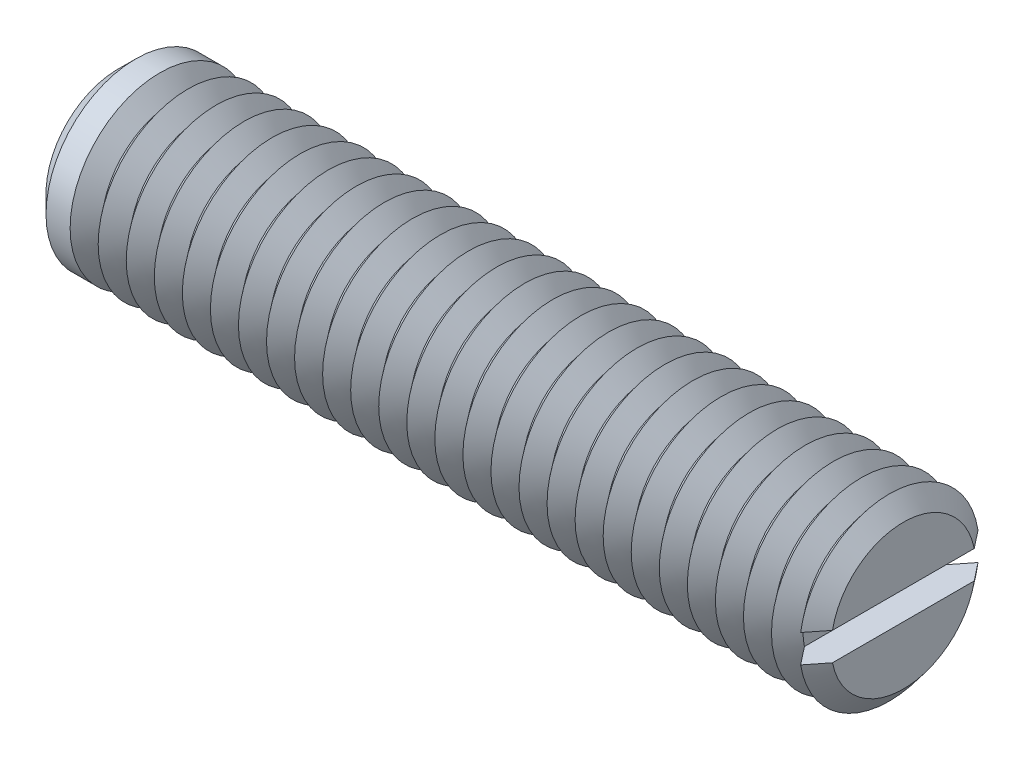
from build123d import *

# Parameters (mm, degrees)
SKETCH1_R       = 4
EXTRUDE1_DEPTH  = 17.5
SKETCH2_W       = 1.25
SKETCH2_H       = 1.25
EXTRUDE2_DEPTH  = 6
CHAMFER1_SIZE   = 0.8
LPATTERN1_COUNT = 27
LPATTERN1_PITCH = 1.25


with BuildPart() as part:
    # Sketch1 → Extrude1 (new, symmetric)
    with BuildSketch(Plane(origin=(0, 0, 0), x_dir=(0, 0, -1), z_dir=(1, 0, 0))):
        Circle(SKETCH1_R)
    extrude(amount=EXTRUDE1_DEPTH, both=True)

    # Sketch2 → Extrude2 (cut, symmetric)
    with BuildSketch(Plane.XY):
        with Locations((16.875, 0)):
            Rectangle(SKETCH2_W, SKETCH2_H)
    extrude(amount=EXTRUDE2_DEPTH, both=True, mode=Mode.SUBTRACT)

    # Chamfer1
    chamfer1_edges = [part.edges().sort_by_distance(p)[0] for p in [
        (-17.5, 0, 4),
    ]]
    chamfer(chamfer1_edges, length=CHAMFER1_SIZE)

    # Sketch3 → Cut-Revolve1 (revolve, cut)
    with BuildSketch(Plane.XY, mode=Mode.PRIVATE) as cut_revolve1_sk:
        Polygon((16.875, -4), (18.125, -4), (17.5, -3.21937525), align=None)
    cut_revolve1 = revolve(cut_revolve1_sk.sketch.rotate(Axis((0, 0, 0), (1, 0, 0)), 278.989299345), axis=Axis((0, 0, 0), (1, 0, 0)), mode=Mode.SUBTRACT)

    # LPattern1: Cut-Revolve1 ×27
    with Locations(*[(-i * LPATTERN1_PITCH, 0, 0) for i in range(1, LPATTERN1_COUNT)]):
        add(cut_revolve1, mode=Mode.SUBTRACT)


solid = part.part
